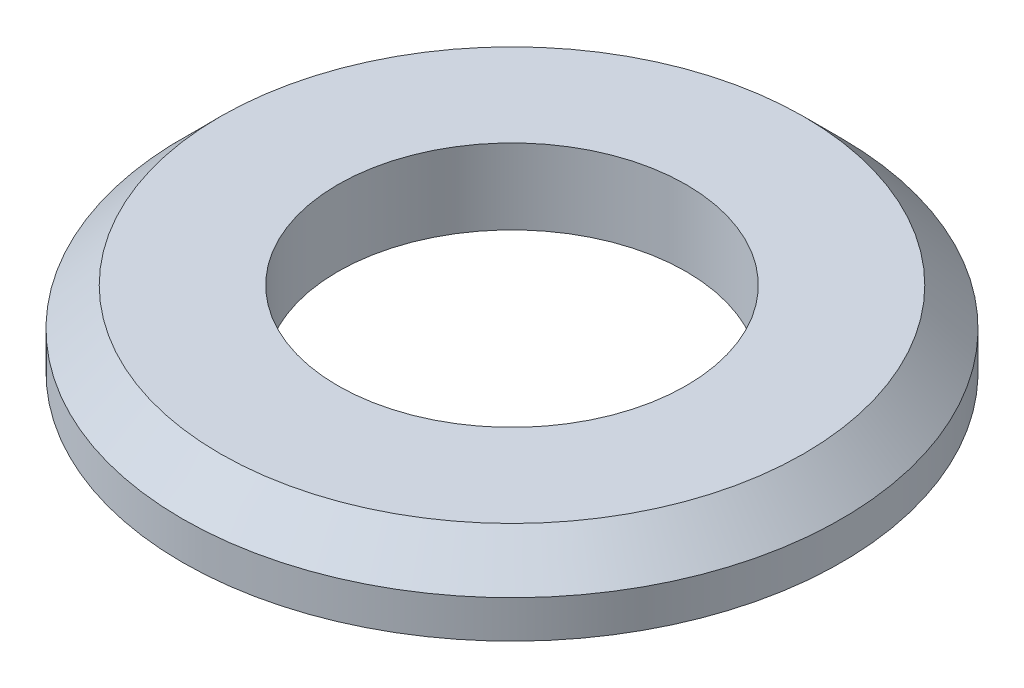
from build123d import *

# Parameters (mm, degrees)
SKETCH1_R      = 7
SKETCH1_R_2    = 3.7
EXTRUDE1_DEPTH = 1.6
CHAMFER1_SIZE  = 0.8


with BuildPart() as part:
    # Sketch1 → Extrude1 (new body)
    with BuildSketch(Plane(origin=(0, 0, 0), x_dir=(1, 0, 0), z_dir=(0, 1, 0))):
        with Locations(Location((0, 0, 0), (0, 0, 270))):
            Circle(SKETCH1_R)
        with Locations(Location((0, 0, 0), (0, 0, 270))):
            Circle(SKETCH1_R_2, mode=Mode.SUBTRACT)
    extrude(amount=EXTRUDE1_DEPTH)

    # Chamfer1
    chamfer1_edges = [part.edges().sort_by_distance(p)[0] for p in [
        (0, 1.6, -7),
    ]]
    chamfer(chamfer1_edges, length=CHAMFER1_SIZE)


solid = part.part
